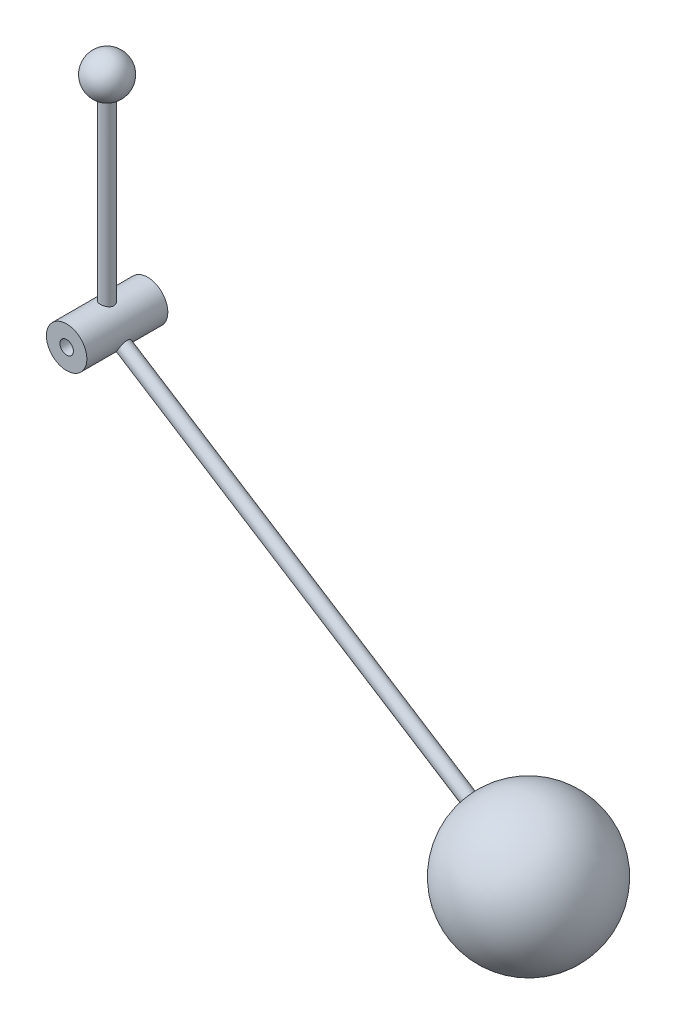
ISO-10303-21;
HEADER;
FILE_DESCRIPTION(('STEP AP214'),'2;1');
FILE_NAME('part.step','',(''),(''),'','','');
FILE_SCHEMA(('AUTOMOTIVE_DESIGN { 1 0 10303 214 1 1 1 1 }'));
ENDSEC;
DATA;
#1=APPLICATION_CONTEXT('core data for automotive mechanical design processes');
#2=APPLICATION_PROTOCOL_DEFINITION('international standard','automotive_design',2000,#1);
#3=PRODUCT_CONTEXT('',#1,'mechanical');
#4=PRODUCT('Part','Part','',(#3));
#5=PRODUCT_RELATED_PRODUCT_CATEGORY('part','',(#4));
#6=PRODUCT_DEFINITION_FORMATION('','',#4);
#7=PRODUCT_DEFINITION_CONTEXT('part definition',#1,'design');
#8=PRODUCT_DEFINITION('design','',#6,#7);
#9=PRODUCT_DEFINITION_SHAPE('','',#8);
#10=(LENGTH_UNIT() NAMED_UNIT(*) SI_UNIT(.MILLI.,.METRE.));
#11=(NAMED_UNIT(*) PLANE_ANGLE_UNIT() SI_UNIT($,.RADIAN.));
#12=(NAMED_UNIT(*) SI_UNIT($,.STERADIAN.) SOLID_ANGLE_UNIT());
#13=UNCERTAINTY_MEASURE_WITH_UNIT(LENGTH_MEASURE(1.E-05),#10,'distance_accuracy_value','');
#14=(GEOMETRIC_REPRESENTATION_CONTEXT(3) GLOBAL_UNCERTAINTY_ASSIGNED_CONTEXT((#13)) GLOBAL_UNIT_ASSIGNED_CONTEXT((#10,
#11,#12)) REPRESENTATION_CONTEXT('',''));
#15=CARTESIAN_POINT('',(0.,0.,0.));
#16=DIRECTION('',(0.,0.,1.));
#17=DIRECTION('',(1.,0.,0.));
#18=AXIS2_PLACEMENT_3D('',#15,#16,#17);
#19=CARTESIAN_POINT('',(0.,-80.,0.));
#20=DIRECTION('',(-0.843661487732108,0.536875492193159,0.));
#21=DIRECTION('',(-0.536875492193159,-0.843661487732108,0.));
#22=AXIS2_PLACEMENT_3D('',#19,#20,#21);
#23=CYLINDRICAL_SURFACE('',#22,2.49999999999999);
#24=CARTESIAN_POINT('',(4.62339885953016,-85.9054367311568,0.));
#25=CARTESIAN_POINT('',(4.62339813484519,-85.9054370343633,-0.13617043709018));
#26=CARTESIAN_POINT('',(4.63274677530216,-85.8981537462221,-0.272336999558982));
#27=CARTESIAN_POINT('',(4.66946984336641,-85.8691214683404,-0.540636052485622));
#28=CARTESIAN_POINT('',(4.69684724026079,-85.8473700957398,-0.672767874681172));
#29=CARTESIAN_POINT('',(4.76772549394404,-85.7897198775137,-0.929067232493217));
#30=CARTESIAN_POINT('',(4.81119474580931,-85.7538487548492,-1.05324982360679));
#31=CARTESIAN_POINT('',(4.91169594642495,-85.6682962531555,-1.2909001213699));
#32=CARTESIAN_POINT('',(4.96873088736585,-85.6186118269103,-1.40436545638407));
#33=CARTESIAN_POINT('',(5.09564555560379,-85.5038130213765,-1.62179990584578));
#34=CARTESIAN_POINT('',(5.16590956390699,-85.4382132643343,-1.72528857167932));
#35=CARTESIAN_POINT('',(5.31441764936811,-85.2931772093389,-1.91551700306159));
#36=CARTESIAN_POINT('',(5.39266300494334,-85.2137386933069,-2.00225407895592));
#37=CARTESIAN_POINT('',(5.55575897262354,-85.0396541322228,-2.15869724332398));
#38=CARTESIAN_POINT('',(5.64072865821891,-84.9446653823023,-2.22789992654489));
#39=CARTESIAN_POINT('',(5.81160740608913,-84.7426458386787,-2.34397896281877));
#40=CARTESIAN_POINT('',(5.89751620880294,-84.6356183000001,-2.39086133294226));
#41=CARTESIAN_POINT('',(6.06368206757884,-84.4158876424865,-2.45933963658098));
#42=CARTESIAN_POINT('',(6.14403176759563,-84.3035115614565,-2.48175861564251));
#43=CARTESIAN_POINT('',(6.2992582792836,-84.0729156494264,-2.50329073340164));
#44=CARTESIAN_POINT('',(6.37413649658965,-83.9546973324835,-2.50240987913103));
#45=CARTESIAN_POINT('',(6.51333300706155,-83.720793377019,-2.47788936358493));
#46=CARTESIAN_POINT('',(6.57795028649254,-83.6051902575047,-2.45514367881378));
#47=CARTESIAN_POINT('',(6.69872407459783,-83.3754915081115,-2.38901754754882));
#48=CARTESIAN_POINT('',(6.75488000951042,-83.2613959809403,-2.34563570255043));
#49=CARTESIAN_POINT('',(6.85885113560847,-83.0367249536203,-2.23894670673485));
#50=CARTESIAN_POINT('',(6.90654699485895,-82.9262154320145,-2.17538515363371));
#51=CARTESIAN_POINT('',(6.99278286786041,-82.7136985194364,-2.03035073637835));
#52=CARTESIAN_POINT('',(7.03132032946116,-82.6116935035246,-1.94887289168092));
#53=CARTESIAN_POINT('',(7.10140306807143,-82.4148513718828,-1.76581401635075));
#54=CARTESIAN_POINT('',(7.13253371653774,-82.3205778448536,-1.66346710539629));
#55=CARTESIAN_POINT('',(7.186298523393,-82.1483194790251,-1.44387818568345));
#56=CARTESIAN_POINT('',(7.20893137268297,-82.0703371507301,-1.32663388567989));
#57=CARTESIAN_POINT('',(7.24698889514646,-81.9329578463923,-1.0783659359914));
#58=CARTESIAN_POINT('',(7.2623062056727,-81.8738416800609,-0.947169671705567));
#59=CARTESIAN_POINT('',(7.28618348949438,-81.7787529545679,-0.676071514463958));
#60=CARTESIAN_POINT('',(7.2947462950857,-81.7427706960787,-0.536173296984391));
#61=CARTESIAN_POINT('',(7.30551197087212,-81.6970635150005,-0.25840411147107));
#62=CARTESIAN_POINT('',(7.30798434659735,-81.6862272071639,-0.120726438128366));
#63=CARTESIAN_POINT('',(7.30754117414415,-81.6881488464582,0.154440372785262));
#64=CARTESIAN_POINT('',(7.30462660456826,-81.7009025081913,0.291929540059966));
#65=CARTESIAN_POINT('',(7.29339173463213,-81.7484253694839,0.55789241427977));
#66=CARTESIAN_POINT('',(7.28526056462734,-81.7824232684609,0.6865135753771));
#67=CARTESIAN_POINT('',(7.26326159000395,-81.870042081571,0.936359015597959));
#68=CARTESIAN_POINT('',(7.24939276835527,-81.9236664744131,1.05758197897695));
#69=CARTESIAN_POINT('',(7.21464348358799,-82.0502054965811,1.29345105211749));
#70=CARTESIAN_POINT('',(7.19355457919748,-82.1236780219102,1.4077666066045));
#71=CARTESIAN_POINT('',(7.14357594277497,-82.2861619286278,1.62286513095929));
#72=CARTESIAN_POINT('',(7.11468391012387,-82.3751778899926,1.72364409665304));
#73=CARTESIAN_POINT('',(7.04662432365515,-82.570261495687,1.91381996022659));
#74=CARTESIAN_POINT('',(7.0070292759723,-82.6769434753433,2.00243597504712));
#75=CARTESIAN_POINT('',(6.91759176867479,-82.9002358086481,2.1597903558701));
#76=CARTESIAN_POINT('',(6.8677496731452,-83.0168458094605,2.22852942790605));
#77=CARTESIAN_POINT('',(6.75802450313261,-83.2551777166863,2.34355026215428));
#78=CARTESIAN_POINT('',(6.69821033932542,-83.3768605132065,2.38997819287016));
#79=CARTESIAN_POINT('',(6.5689892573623,-83.6218118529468,2.45931935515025));
#80=CARTESIAN_POINT('',(6.49958581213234,-83.7450798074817,2.48224107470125));
#81=CARTESIAN_POINT('',(6.35628222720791,-83.9832253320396,2.5031551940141));
#82=CARTESIAN_POINT('',(6.28274674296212,-84.0982249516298,2.50226863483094));
#83=CARTESIAN_POINT('',(6.13065096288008,-84.3224375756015,2.47835672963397));
#84=CARTESIAN_POINT('',(6.05209107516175,-84.431651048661,2.45533317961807));
#85=CARTESIAN_POINT('',(5.89397366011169,-84.6398174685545,2.38854441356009));
#86=CARTESIAN_POINT('',(5.81445179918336,-84.7389058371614,2.34511446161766));
#87=CARTESIAN_POINT('',(5.65610587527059,-84.9268226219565,2.23905617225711));
#88=CARTESIAN_POINT('',(5.57728194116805,-85.0156491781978,2.17642436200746));
#89=CARTESIAN_POINT('',(5.4204881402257,-85.1847954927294,2.03107621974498));
#90=CARTESIAN_POINT('',(5.34265744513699,-85.2646796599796,1.9477032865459));
#91=CARTESIAN_POINT('',(5.19430136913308,-85.4111106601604,1.76435652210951));
#92=CARTESIAN_POINT('',(5.12377833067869,-85.4776532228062,1.66437739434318));
#93=CARTESIAN_POINT('',(4.99078846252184,-85.5991491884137,1.44597661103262));
#94=CARTESIAN_POINT('',(4.92874505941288,-85.65354696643,1.3269862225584));
#95=CARTESIAN_POINT('',(4.81968868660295,-85.7468056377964,1.07666393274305));
#96=CARTESIAN_POINT('',(4.77267178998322,-85.785670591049,0.945335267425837));
#97=CARTESIAN_POINT('',(4.6984735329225,-85.8460708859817,0.680095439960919));
#98=CARTESIAN_POINT('',(4.67049163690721,-85.8683101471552,0.546569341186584));
#99=CARTESIAN_POINT('',(4.6329578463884,-85.8979903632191,0.275359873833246));
#100=CARTESIAN_POINT('',(4.62339959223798,-85.9054364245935,0.137677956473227));
#101=CARTESIAN_POINT('',(4.62339885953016,-85.9054367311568,0.));
#102=B_SPLINE_CURVE_WITH_KNOTS('',3,(#24,#25,#26,#27,#28,#29,#30,#31,#32,#33,#34,#35,#36,#37,
#38,#39,#40,#41,#42,#43,#44,#45,#46,#47,#48,#49,#50,#51,#52,#53,#54,#55,#56,#57,#58,#59,#60,#61,
#62,#63,#64,#65,#66,#67,#68,#69,#70,#71,#72,#73,#74,#75,#76,#77,#78,#79,#80,#81,#82,#83,#84,#85,
#86,#87,#88,#89,#90,#91,#92,#93,#94,#95,#96,#97,#98,#99,#100,#101),.UNSPECIFIED.,.T.,.F.,(4,2,2,
2,2,2,2,2,2,2,2,2,2,2,2,2,2,2,2,2,2,2,2,2,2,2,2,2,2,2,2,2,2,2,2,2,2,2,4),(0.,0.408001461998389,
0.816070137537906,1.22334156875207,1.6307029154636,2.0525334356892,2.47443162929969,
2.90733765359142,3.34012690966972,3.75785796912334,4.17548133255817,4.5767251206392,
4.9779961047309,5.38454137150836,5.79119979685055,6.21700435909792,6.64287449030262,
7.07481599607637,7.50657628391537,7.91885728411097,8.33106339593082,8.72910989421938,
9.12722697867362,9.53797144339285,9.94883714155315,10.3794702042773,10.8100879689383,
11.2378447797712,11.6654470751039,12.0729521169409,12.4804241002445,12.8814239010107,
13.282496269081,13.6983879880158,14.1144126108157,14.5467225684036,14.9789194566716,
15.3915803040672,15.8040986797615),.UNSPECIFIED.);
#103=CARTESIAN_POINT('',(4.62339885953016,-85.9054367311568,0.));
#104=VERTEX_POINT('',#103);
#105=EDGE_CURVE('E34',#104,#104,#102,.T.);
#106=ORIENTED_EDGE('',*,*,#105,.T.);
#107=EDGE_LOOP('',(#106));
#108=FACE_BOUND('',#107,.T.);
#109=CARTESIAN_POINT('',(133.878557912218,-165.195445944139,0.));
#110=DIRECTION('',(0.843661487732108,-0.536875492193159,0.));
#111=DIRECTION('',(0.536875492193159,0.843661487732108,0.));
#112=AXIS2_PLACEMENT_3D('',#109,#110,#111);
#113=CIRCLE('',#112,2.49999999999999);
#114=CARTESIAN_POINT('',(135.220746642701,-163.086292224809,0.));
#115=VERTEX_POINT('',#114);
#116=EDGE_CURVE('E10',#115,#115,#113,.T.);
#117=ORIENTED_EDGE('',*,*,#116,.F.);
#118=EDGE_LOOP('',(#117));
#119=FACE_BOUND('',#118,.T.);
#120=ADVANCED_FACE('F27',(#108,#119),#23,.T.);
#121=CARTESIAN_POINT('',(0.,-80.,15.));
#122=DIRECTION('',(0.,0.,-1.));
#123=DIRECTION('',(-1.,0.,0.));
#124=AXIS2_PLACEMENT_3D('',#121,#122,#123);
#125=CYLINDRICAL_SURFACE('',#124,7.50000000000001);
#126=CARTESIAN_POINT('',(0.,-80.,-15.));
#127=DIRECTION('',(0.,0.,1.));
#128=DIRECTION('',(1.,0.,0.));
#129=AXIS2_PLACEMENT_3D('',#126,#127,#128);
#130=CIRCLE('',#129,7.50000000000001);
#131=CARTESIAN_POINT('',(7.50000000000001,-80.,-15.));
#132=VERTEX_POINT('',#131);
#133=EDGE_CURVE('E82',#132,#132,#130,.T.);
#134=ORIENTED_EDGE('',*,*,#133,.T.);
#135=EDGE_LOOP('',(#134));
#136=FACE_BOUND('',#135,.T.);
#137=CARTESIAN_POINT('',(0.,-80.,15.));
#138=DIRECTION('',(0.,0.,1.));
#139=DIRECTION('',(1.,0.,0.));
#140=AXIS2_PLACEMENT_3D('',#137,#138,#139);
#141=CIRCLE('',#140,7.50000000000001);
#142=CARTESIAN_POINT('',(7.50000000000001,-80.,15.));
#143=VERTEX_POINT('',#142);
#144=EDGE_CURVE('E80',#143,#143,#141,.T.);
#145=ORIENTED_EDGE('',*,*,#144,.F.);
#146=EDGE_LOOP('',(#145));
#147=FACE_BOUND('',#146,.T.);
#148=CARTESIAN_POINT('',(0.,-72.5,2.50000000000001));
#149=CARTESIAN_POINT('',(-0.136408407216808,-72.4999996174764,2.50000063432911));
#150=CARTESIAN_POINT('',(-0.272812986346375,-72.5037557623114,2.48879933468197));
#151=CARTESIAN_POINT('',(-0.541604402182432,-72.518369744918,2.44442722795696));
#152=CARTESIAN_POINT('',(-0.673990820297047,-72.5292283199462,2.4112541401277));
#153=CARTESIAN_POINT('',(-0.930831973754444,-72.5568673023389,2.32420189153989));
#154=CARTESIAN_POINT('',(-1.05529956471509,-72.5736378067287,2.27035734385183));
#155=CARTESIAN_POINT('',(-1.29343734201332,-72.6113888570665,2.14364706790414));
#156=CARTESIAN_POINT('',(-1.40710539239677,-72.6323702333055,2.07077758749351));
#157=CARTESIAN_POINT('',(-1.62435418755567,-72.6771476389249,1.90543548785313));
#158=CARTESIAN_POINT('',(-1.72750925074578,-72.7010110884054,1.81242191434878));
#159=CARTESIAN_POINT('',(-1.91708173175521,-72.748492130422,1.61058211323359));
#160=CARTESIAN_POINT('',(-2.00349546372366,-72.7721096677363,1.50175241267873));
#161=CARTESIAN_POINT('',(-2.15956235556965,-72.8171666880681,1.26753721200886));
#162=CARTESIAN_POINT('',(-2.22866214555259,-72.8385240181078,1.1417656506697));
#163=CARTESIAN_POINT('',(-2.34454718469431,-72.875617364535,0.87955976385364));
#164=CARTESIAN_POINT('',(-2.39133924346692,-72.8913550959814,0.743128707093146));
#165=CARTESIAN_POINT('',(-2.45968365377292,-72.9147174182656,0.468316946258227));
#166=CARTESIAN_POINT('',(-2.48203362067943,-72.9225976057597,0.330156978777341));
#167=CARTESIAN_POINT('',(-2.5033528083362,-72.9301085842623,0.0518406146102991));
#168=CARTESIAN_POINT('',(-2.50232925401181,-72.9297419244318,-0.0883151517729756));
#169=CARTESIAN_POINT('',(-2.47754975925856,-72.9210246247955,-0.359841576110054));
#170=CARTESIAN_POINT('',(-2.4548347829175,-72.9130396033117,-0.491321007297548));
#171=CARTESIAN_POINT('',(-2.38901540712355,-72.8905835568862,-0.748483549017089));
#172=CARTESIAN_POINT('',(-2.34590856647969,-72.8761117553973,-0.874165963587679));
#173=CARTESIAN_POINT('',(-2.23984764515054,-72.8420522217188,-1.1185318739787));
#174=CARTESIAN_POINT('',(-2.17658512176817,-72.8223858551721,-1.23707006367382));
#175=CARTESIAN_POINT('',(-2.03222276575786,-72.7801860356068,-1.46217727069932));
#176=CARTESIAN_POINT('',(-1.95111778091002,-72.7576517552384,-1.56874281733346));
#177=CARTESIAN_POINT('',(-1.7683733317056,-72.7108167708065,-1.77272899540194));
#178=CARTESIAN_POINT('',(-1.66588287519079,-72.6864852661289,-1.86938173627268));
#179=CARTESIAN_POINT('',(-1.44584892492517,-72.6398265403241,-2.0443281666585));
#180=CARTESIAN_POINT('',(-1.32830398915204,-72.6174995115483,-2.12262009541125));
#181=CARTESIAN_POINT('',(-1.07986903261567,-72.5770723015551,-2.25924075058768));
#182=CARTESIAN_POINT('',(-0.948858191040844,-72.559016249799,-2.31736372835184));
#183=CARTESIAN_POINT('',(-0.678172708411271,-72.5294858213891,-2.41050793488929));
#184=CARTESIAN_POINT('',(-0.538501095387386,-72.518009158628,-2.4455371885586));
#185=CARTESIAN_POINT('',(-0.260959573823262,-72.503309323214,-2.49013916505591));
#186=CARTESIAN_POINT('',(-0.123273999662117,-72.4997499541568,-2.50074952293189));
#187=CARTESIAN_POINT('',(0.151937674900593,-72.5002774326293,-2.49916831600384));
#188=CARTESIAN_POINT('',(0.289463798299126,-72.5043629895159,-2.48698060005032));
#189=CARTESIAN_POINT('',(0.55629966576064,-72.5194993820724,-2.44097023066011));
#190=CARTESIAN_POINT('',(0.68573201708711,-72.5303450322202,-2.40778448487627));
#191=CARTESIAN_POINT('',(0.937139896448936,-72.5577038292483,-2.32151638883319));
#192=CARTESIAN_POINT('',(1.05911447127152,-72.5742176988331,-2.26843150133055));
#193=CARTESIAN_POINT('',(1.29572074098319,-72.6117767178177,-2.14232392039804));
#194=CARTESIAN_POINT('',(1.41007489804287,-72.6329296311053,-2.06881351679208));
#195=CARTESIAN_POINT('',(1.62516207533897,-72.6773686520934,-1.9045146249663));
#196=CARTESIAN_POINT('',(1.72589091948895,-72.7006554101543,-1.8137208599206));
#197=CARTESIAN_POINT('',(1.91563126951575,-72.7480788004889,-1.61255312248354));
#198=CARTESIAN_POINT('',(2.00390242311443,-72.7722059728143,-1.50147693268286));
#199=CARTESIAN_POINT('',(2.16064380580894,-72.8175006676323,-1.26557108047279));
#200=CARTESIAN_POINT('',(2.22911386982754,-72.8386681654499,-1.14074130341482));
#201=CARTESIAN_POINT('',(2.34399232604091,-72.8754402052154,-0.880817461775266));
#202=CARTESIAN_POINT('',(2.39044533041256,-72.8910559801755,-0.745744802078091));
#203=CARTESIAN_POINT('',(2.4597366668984,-72.9147291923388,-0.469053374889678));
#204=CARTESIAN_POINT('',(2.48258563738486,-72.922790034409,-0.327437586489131));
#205=CARTESIAN_POINT('',(2.50319070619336,-72.9300535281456,-0.0495072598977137));
#206=CARTESIAN_POINT('',(2.50217564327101,-72.9296899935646,0.0867058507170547));
#207=CARTESIAN_POINT('',(2.47810573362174,-72.9212182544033,0.356912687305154));
#208=CARTESIAN_POINT('',(2.45505219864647,-72.913110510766,0.49090654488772));
#209=CARTESIAN_POINT('',(2.38842953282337,-72.8903868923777,0.750339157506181));
#210=CARTESIAN_POINT('',(2.3452583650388,-72.8758975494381,0.875892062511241));
#211=CARTESIAN_POINT('',(2.23994841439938,-72.8420900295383,1.11806851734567));
#212=CARTESIAN_POINT('',(2.17780542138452,-72.8227707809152,1.23469007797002));
#213=CARTESIAN_POINT('',(2.03315173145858,-72.7804292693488,1.46120917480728));
#214=CARTESIAN_POINT('',(1.94987060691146,-72.7572822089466,1.57059125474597));
#215=CARTESIAN_POINT('',(1.76660720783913,-72.7104160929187,1.77422453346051));
#216=CARTESIAN_POINT('',(1.66662021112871,-72.6866968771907,1.86847143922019));
#217=CARTESIAN_POINT('',(1.44810389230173,-72.6402492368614,2.04286103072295));
#218=CARTESIAN_POINT('',(1.32900378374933,-72.6175954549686,2.1223108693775));
#219=CARTESIAN_POINT('',(1.07839339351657,-72.5768502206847,2.25997607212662));
#220=CARTESIAN_POINT('',(0.946886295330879,-72.5587576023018,2.31819686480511));
#221=CARTESIAN_POINT('',(0.681234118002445,-72.5298621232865,2.40930408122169));
#222=CARTESIAN_POINT('',(0.547469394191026,-72.5187696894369,2.44320616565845));
#223=CARTESIAN_POINT('',(0.27580104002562,-72.5038398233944,2.48855070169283));
#224=CARTESIAN_POINT('',(0.137898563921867,-72.5000003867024,2.49999935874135));
#225=CARTESIAN_POINT('',(0.,-72.5,2.50000000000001));
#226=B_SPLINE_CURVE_WITH_KNOTS('',3,(#148,#149,#150,#151,#152,#153,#154,#155,#156,#157,#158,
#159,#160,#161,#162,#163,#164,#165,#166,#167,#168,#169,#170,#171,#172,#173,#174,#175,#176,#177,
#178,#179,#180,#181,#182,#183,#184,#185,#186,#187,#188,#189,#190,#191,#192,#193,#194,#195,#196,
#197,#198,#199,#200,#201,#202,#203,#204,#205,#206,#207,#208,#209,#210,#211,#212,#213,#214,#215,
#216,#217,#218,#219,#220,#221,#222,#223,#224,#225),.UNSPECIFIED.,.T.,.F.,(4,2,2,2,2,2,2,2,2,2,2,
2,2,2,2,2,2,2,2,2,2,2,2,2,2,2,2,2,2,2,2,2,2,2,2,2,2,2,4),(0.,0.408717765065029,
0.817477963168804,1.22555668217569,1.63371594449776,2.0546171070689,2.47561083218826,
2.90870962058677,3.34167611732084,3.76004814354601,4.17829084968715,4.57742066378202,
4.97659827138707,5.38220427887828,5.7879275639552,6.2148326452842,6.64177864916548,
7.07296014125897,7.50399172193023,7.91633957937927,8.32861782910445,8.72895394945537,
9.12934113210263,9.54025999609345,9.95130452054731,10.3810255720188,10.810750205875,
11.2396003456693,11.668257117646,12.0748916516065,12.4815019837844,12.8803896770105,
13.2793659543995,13.6957516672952,14.1122552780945,14.5449915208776,14.9776170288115,
15.3909139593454,15.8040966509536),.UNSPECIFIED.);
#227=CARTESIAN_POINT('',(0.,-72.5,2.50000000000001));
#228=VERTEX_POINT('',#227);
#229=EDGE_CURVE('E38',#228,#228,#226,.T.);
#230=ORIENTED_EDGE('',*,*,#229,.T.);
#231=EDGE_LOOP('',(#230));
#232=FACE_BOUND('',#231,.T.);
#233=ORIENTED_EDGE('',*,*,#105,.F.);
#234=EDGE_LOOP('',(#233));
#235=FACE_BOUND('',#234,.T.);
#236=ADVANCED_FACE('F51',(#136,#147,#232,#235),#125,.T.);
#237=CARTESIAN_POINT('',(0.,30.,0.));
#238=DIRECTION('',(0.,1.,0.));
#239=DIRECTION('',(0.,0.,1.));
#240=AXIS2_PLACEMENT_3D('',#237,#238,#239);
#241=CYLINDRICAL_SURFACE('',#240,2.50000000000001);
#242=CARTESIAN_POINT('',(0.,-7.07106781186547,0.));
#243=DIRECTION('',(0.,1.,0.));
#244=DIRECTION('',(0.,0.,1.));
#245=AXIS2_PLACEMENT_3D('',#242,#243,#244);
#246=CIRCLE('',#245,2.50000000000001);
#247=CARTESIAN_POINT('',(0.,-7.07106781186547,2.50000000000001));
#248=VERTEX_POINT('',#247);
#249=EDGE_CURVE('E42',#248,#248,#246,.F.);
#250=ORIENTED_EDGE('',*,*,#249,.T.);
#251=EDGE_LOOP('',(#250));
#252=FACE_BOUND('',#251,.T.);
#253=ORIENTED_EDGE('',*,*,#229,.F.);
#254=EDGE_LOOP('',(#253));
#255=FACE_BOUND('',#254,.T.);
#256=ADVANCED_FACE('F72',(#252,#255),#241,.T.);
#257=CARTESIAN_POINT('',(0.,0.,0.));
#258=DIRECTION('',(-1.,0.,0.));
#259=DIRECTION('',(0.,1.,0.));
#260=AXIS2_PLACEMENT_3D('',#257,#258,#259);
#261=SPHERICAL_SURFACE('',#260,7.5);
#262=CARTESIAN_POINT('',(0.,0.,0.));
#263=DIRECTION('',(0.,1.,0.));
#264=DIRECTION('',(0.,0.,1.));
#265=AXIS2_PLACEMENT_3D('',#262,#263,#264);
#266=SPHERICAL_SURFACE('',#265,7.5);
#267=ORIENTED_EDGE('',*,*,#249,.F.);
#268=EDGE_LOOP('',(#267));
#269=FACE_BOUND('',#268,.T.);
#270=ADVANCED_FACE('F29',(#269),#266,.T.);
#271=CARTESIAN_POINT('',(0.,-80.,15.));
#272=DIRECTION('',(0.,0.,1.));
#273=DIRECTION('',(1.,0.,0.));
#274=AXIS2_PLACEMENT_3D('',#271,#272,#273);
#275=PLANE('',#274);
#276=CARTESIAN_POINT('',(0.,-80.,15.));
#277=DIRECTION('',(0.,0.,1.));
#278=DIRECTION('',(1.,0.,0.));
#279=AXIS2_PLACEMENT_3D('',#276,#277,#278);
#280=CIRCLE('',#279,2.5);
#281=CARTESIAN_POINT('',(2.5,-80.,15.));
#282=VERTEX_POINT('',#281);
#283=EDGE_CURVE('E77',#282,#282,#280,.T.);
#284=ORIENTED_EDGE('',*,*,#283,.F.);
#285=EDGE_LOOP('',(#284));
#286=FACE_BOUND('',#285,.T.);
#287=ORIENTED_EDGE('',*,*,#144,.T.);
#288=EDGE_LOOP('',(#287));
#289=FACE_BOUND('',#288,.T.);
#290=ADVANCED_FACE('F65',(#286,#289),#275,.T.);
#291=CARTESIAN_POINT('',(0.,-80.,-15.));
#292=DIRECTION('',(0.,0.,1.));
#293=DIRECTION('',(1.,0.,0.));
#294=AXIS2_PLACEMENT_3D('',#291,#292,#293);
#295=PLANE('',#294);
#296=CARTESIAN_POINT('',(0.,-80.,-15.));
#297=DIRECTION('',(0.,0.,1.));
#298=DIRECTION('',(1.,0.,0.));
#299=AXIS2_PLACEMENT_3D('',#296,#297,#298);
#300=CIRCLE('',#299,2.5);
#301=CARTESIAN_POINT('',(2.5,-80.,-15.));
#302=VERTEX_POINT('',#301);
#303=EDGE_CURVE('E86',#302,#302,#300,.T.);
#304=ORIENTED_EDGE('',*,*,#303,.T.);
#305=EDGE_LOOP('',(#304));
#306=FACE_BOUND('',#305,.T.);
#307=ORIENTED_EDGE('',*,*,#133,.F.);
#308=EDGE_LOOP('',(#307));
#309=FACE_BOUND('',#308,.T.);
#310=ADVANCED_FACE('F62',(#306,#309),#295,.F.);
#311=CARTESIAN_POINT('',(0.,-80.,-15.));
#312=DIRECTION('',(0.,0.,1.));
#313=DIRECTION('',(1.,0.,0.));
#314=AXIS2_PLACEMENT_3D('',#311,#312,#313);
#315=CYLINDRICAL_SURFACE('',#314,2.5);
#316=ORIENTED_EDGE('',*,*,#303,.F.);
#317=EDGE_LOOP('',(#316));
#318=FACE_BOUND('',#317,.T.);
#319=ORIENTED_EDGE('',*,*,#283,.T.);
#320=EDGE_LOOP('',(#319));
#321=FACE_BOUND('',#320,.T.);
#322=ADVANCED_FACE('F59',(#318,#321),#315,.F.);
#323=CARTESIAN_POINT('',(156.143901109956,-179.364300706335,0.));
#324=DIRECTION('',(-0.843661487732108,0.536875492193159,0.));
#325=DIRECTION('',(0.536875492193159,0.843661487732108,0.));
#326=AXIS2_PLACEMENT_3D('',#323,#324,#325);
#327=SPHERICAL_SURFACE('',#326,26.5094691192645);
#328=ORIENTED_EDGE('',*,*,#116,.T.);
#329=EDGE_LOOP('',(#328));
#330=FACE_BOUND('',#329,.T.);
#331=ADVANCED_FACE('F58',(#330),#327,.T.);
#332=CLOSED_SHELL('',(#120,#236,#256,#270,#290,#310,#322,#331));
#333=MANIFOLD_SOLID_BREP('B2',#332);
#334=ADVANCED_BREP_SHAPE_REPRESENTATION('',(#18,#333),#14);
#335=SHAPE_DEFINITION_REPRESENTATION(#9,#334);
ENDSEC;
END-ISO-10303-21;
